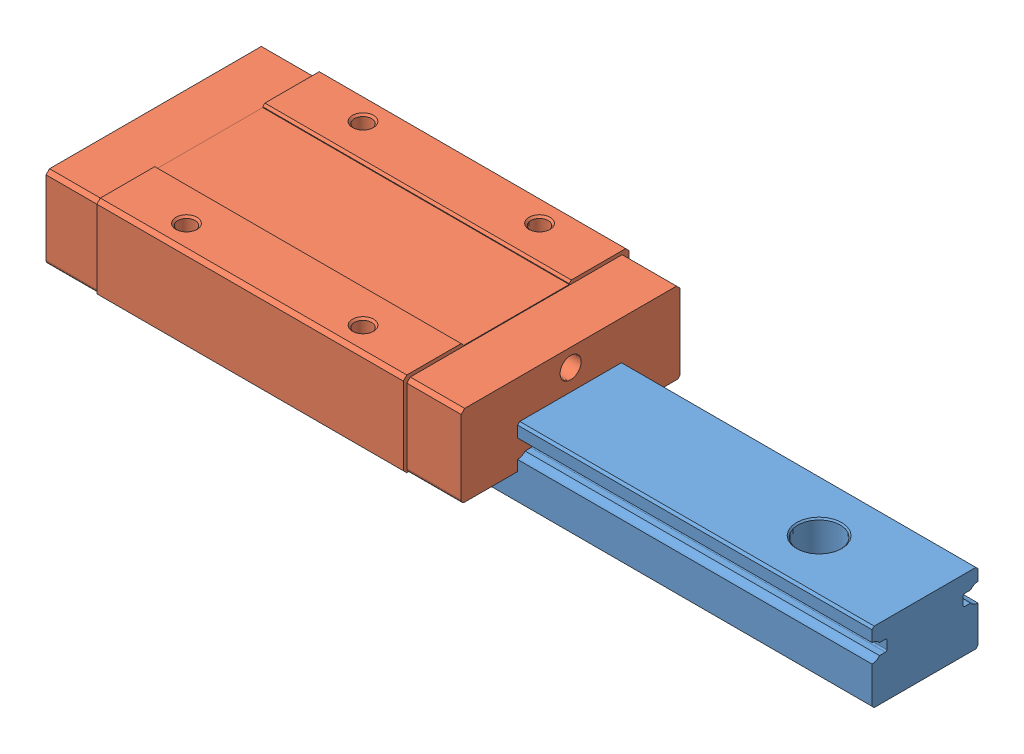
SolidWorks assembly MLN15H.stp.sldasm, configuration 默认 (file format 13000). Lengths in mm.
Overall size (110 16 32).
2 component instances, 2 part files, 0 mates.
Components (placement in the parent):
- MLNR15R110 E=15-1: MLNR15R110 E=15.SLDPRT [默认] at origin size (110 10 15)
- MLN15H-1: MLN15H.SLDPRT [默认] at (1 4 0) size (58.8 12 32)
